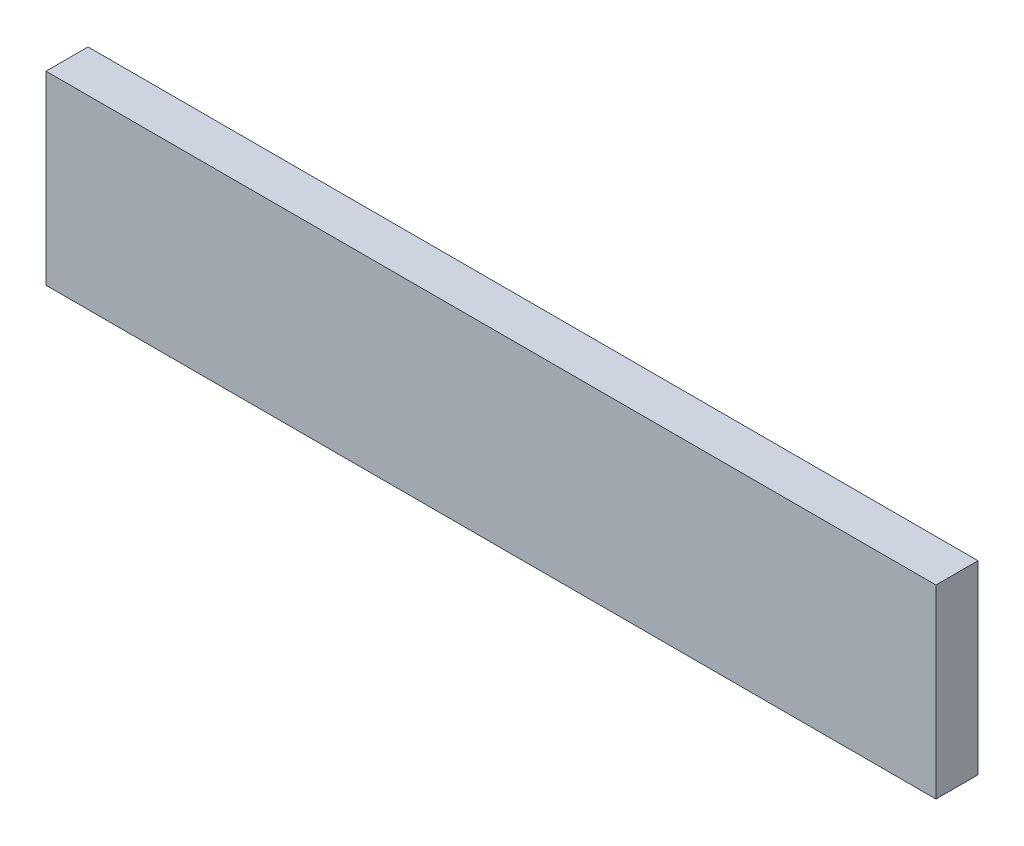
ISO-10303-21;
HEADER;
FILE_DESCRIPTION(('STEP AP214'),'2;1');
FILE_NAME('part.step','',(''),(''),'','','');
FILE_SCHEMA(('AUTOMOTIVE_DESIGN { 1 0 10303 214 1 1 1 1 }'));
ENDSEC;
DATA;
#1=APPLICATION_CONTEXT('core data for automotive mechanical design processes');
#2=APPLICATION_PROTOCOL_DEFINITION('international standard','automotive_design',2000,#1);
#3=PRODUCT_CONTEXT('',#1,'mechanical');
#4=PRODUCT('Part','Part','',(#3));
#5=PRODUCT_RELATED_PRODUCT_CATEGORY('part','',(#4));
#6=PRODUCT_DEFINITION_FORMATION('','',#4);
#7=PRODUCT_DEFINITION_CONTEXT('part definition',#1,'design');
#8=PRODUCT_DEFINITION('design','',#6,#7);
#9=PRODUCT_DEFINITION_SHAPE('','',#8);
#10=(LENGTH_UNIT() NAMED_UNIT(*) SI_UNIT(.MILLI.,.METRE.));
#11=(NAMED_UNIT(*) PLANE_ANGLE_UNIT() SI_UNIT($,.RADIAN.));
#12=(NAMED_UNIT(*) SI_UNIT($,.STERADIAN.) SOLID_ANGLE_UNIT());
#13=UNCERTAINTY_MEASURE_WITH_UNIT(LENGTH_MEASURE(1.E-05),#10,'distance_accuracy_value','');
#14=(GEOMETRIC_REPRESENTATION_CONTEXT(3) GLOBAL_UNCERTAINTY_ASSIGNED_CONTEXT((#13)) GLOBAL_UNIT_ASSIGNED_CONTEXT((#10,
#11,#12)) REPRESENTATION_CONTEXT('',''));
#15=CARTESIAN_POINT('',(0.,0.,0.));
#16=DIRECTION('',(0.,0.,1.));
#17=DIRECTION('',(1.,0.,0.));
#18=AXIS2_PLACEMENT_3D('',#15,#16,#17);
#19=CARTESIAN_POINT('',(0.,0.,7.2));
#20=DIRECTION('',(0.,0.,-1.));
#21=DIRECTION('',(-1.,0.,0.));
#22=AXIS2_PLACEMENT_3D('',#19,#20,#21);
#23=PLANE('',#22);
#24=DIRECTION('',(1.,0.,0.));
#25=VECTOR('',#24,1.);
#26=CARTESIAN_POINT('',(-76.2,15.875,7.2));
#27=LINE('',#26,#25);
#28=CARTESIAN_POINT('',(-76.2,15.875,7.2));
#29=VERTEX_POINT('',#28);
#30=CARTESIAN_POINT('',(76.2,15.875,7.2));
#31=VERTEX_POINT('',#30);
#32=EDGE_CURVE('E66',#29,#31,#27,.T.);
#33=ORIENTED_EDGE('',*,*,#32,.F.);
#34=DIRECTION('',(0.,1.,0.));
#35=VECTOR('',#34,1.);
#36=CARTESIAN_POINT('',(-76.2,-15.875,7.2));
#37=LINE('',#36,#35);
#38=CARTESIAN_POINT('',(-76.2,-15.875,7.2));
#39=VERTEX_POINT('',#38);
#40=EDGE_CURVE('E74',#39,#29,#37,.T.);
#41=ORIENTED_EDGE('',*,*,#40,.F.);
#42=DIRECTION('',(-1.,0.,0.));
#43=VECTOR('',#42,1.);
#44=CARTESIAN_POINT('',(76.2,-15.875,7.2));
#45=LINE('',#44,#43);
#46=CARTESIAN_POINT('',(76.2,-15.875,7.2));
#47=VERTEX_POINT('',#46);
#48=EDGE_CURVE('E68',#47,#39,#45,.T.);
#49=ORIENTED_EDGE('',*,*,#48,.F.);
#50=DIRECTION('',(0.,-1.,0.));
#51=VECTOR('',#50,1.);
#52=CARTESIAN_POINT('',(76.2,15.875,7.2));
#53=LINE('',#52,#51);
#54=EDGE_CURVE('E54',#31,#47,#53,.T.);
#55=ORIENTED_EDGE('',*,*,#54,.F.);
#56=EDGE_LOOP('',(#33,#41,#49,#55));
#57=FACE_BOUND('',#56,.T.);
#58=ADVANCED_FACE('F14',(#57),#23,.F.);
#59=CARTESIAN_POINT('',(76.2,15.875,0.));
#60=DIRECTION('',(1.,0.,0.));
#61=DIRECTION('',(0.,1.,0.));
#62=AXIS2_PLACEMENT_3D('',#59,#60,#61);
#63=PLANE('',#62);
#64=DIRECTION('',(0.,0.,1.));
#65=VECTOR('',#64,1.);
#66=CARTESIAN_POINT('',(76.2,15.875,0.));
#67=LINE('',#66,#65);
#68=CARTESIAN_POINT('',(76.2,15.875,0.));
#69=VERTEX_POINT('',#68);
#70=EDGE_CURVE('E18',#69,#31,#67,.T.);
#71=ORIENTED_EDGE('',*,*,#70,.T.);
#72=ORIENTED_EDGE('',*,*,#54,.T.);
#73=DIRECTION('',(0.,0.,1.));
#74=VECTOR('',#73,1.);
#75=CARTESIAN_POINT('',(76.2,-15.875,0.));
#76=LINE('',#75,#74);
#77=CARTESIAN_POINT('',(76.2,-15.875,0.));
#78=VERTEX_POINT('',#77);
#79=EDGE_CURVE('E9',#78,#47,#76,.T.);
#80=ORIENTED_EDGE('',*,*,#79,.F.);
#81=DIRECTION('',(0.,1.,0.));
#82=VECTOR('',#81,1.);
#83=CARTESIAN_POINT('',(76.2,15.875,0.));
#84=LINE('',#83,#82);
#85=EDGE_CURVE('E55',#78,#69,#84,.T.);
#86=ORIENTED_EDGE('',*,*,#85,.T.);
#87=EDGE_LOOP('',(#71,#72,#80,#86));
#88=FACE_BOUND('',#87,.T.);
#89=ADVANCED_FACE('F16',(#88),#63,.T.);
#90=CARTESIAN_POINT('',(-76.2,-15.875,0.));
#91=DIRECTION('',(0.,-1.,0.));
#92=DIRECTION('',(1.,0.,0.));
#93=AXIS2_PLACEMENT_3D('',#90,#91,#92);
#94=PLANE('',#93);
#95=ORIENTED_EDGE('',*,*,#48,.T.);
#96=DIRECTION('',(0.,0.,1.));
#97=VECTOR('',#96,1.);
#98=CARTESIAN_POINT('',(-76.2,-15.875,0.));
#99=LINE('',#98,#97);
#100=CARTESIAN_POINT('',(-76.2,-15.875,0.));
#101=VERTEX_POINT('',#100);
#102=EDGE_CURVE('E23',#101,#39,#99,.T.);
#103=ORIENTED_EDGE('',*,*,#102,.F.);
#104=DIRECTION('',(1.,0.,0.));
#105=VECTOR('',#104,1.);
#106=CARTESIAN_POINT('',(-76.2,-15.875,0.));
#107=LINE('',#106,#105);
#108=EDGE_CURVE('E61',#101,#78,#107,.T.);
#109=ORIENTED_EDGE('',*,*,#108,.T.);
#110=ORIENTED_EDGE('',*,*,#79,.T.);
#111=EDGE_LOOP('',(#95,#103,#109,#110));
#112=FACE_BOUND('',#111,.T.);
#113=ADVANCED_FACE('F86',(#112),#94,.T.);
#114=CARTESIAN_POINT('',(-76.2,15.875,0.));
#115=DIRECTION('',(-1.,0.,0.));
#116=DIRECTION('',(0.,-1.,0.));
#117=AXIS2_PLACEMENT_3D('',#114,#115,#116);
#118=PLANE('',#117);
#119=ORIENTED_EDGE('',*,*,#102,.T.);
#120=ORIENTED_EDGE('',*,*,#40,.T.);
#121=DIRECTION('',(0.,0.,1.));
#122=VECTOR('',#121,1.);
#123=CARTESIAN_POINT('',(-76.2,15.875,0.));
#124=LINE('',#123,#122);
#125=CARTESIAN_POINT('',(-76.2,15.875,0.));
#126=VERTEX_POINT('',#125);
#127=EDGE_CURVE('E60',#126,#29,#124,.T.);
#128=ORIENTED_EDGE('',*,*,#127,.F.);
#129=DIRECTION('',(0.,-1.,0.));
#130=VECTOR('',#129,1.);
#131=CARTESIAN_POINT('',(-76.2,15.875,0.));
#132=LINE('',#131,#130);
#133=EDGE_CURVE('E79',#126,#101,#132,.T.);
#134=ORIENTED_EDGE('',*,*,#133,.T.);
#135=EDGE_LOOP('',(#119,#120,#128,#134));
#136=FACE_BOUND('',#135,.T.);
#137=ADVANCED_FACE('F83',(#136),#118,.T.);
#138=CARTESIAN_POINT('',(-76.2,15.875,0.));
#139=DIRECTION('',(0.,1.,0.));
#140=DIRECTION('',(-1.,0.,0.));
#141=AXIS2_PLACEMENT_3D('',#138,#139,#140);
#142=PLANE('',#141);
#143=ORIENTED_EDGE('',*,*,#32,.T.);
#144=ORIENTED_EDGE('',*,*,#70,.F.);
#145=DIRECTION('',(-1.,0.,0.));
#146=VECTOR('',#145,1.);
#147=CARTESIAN_POINT('',(-76.2,15.875,0.));
#148=LINE('',#147,#146);
#149=EDGE_CURVE('E77',#69,#126,#148,.T.);
#150=ORIENTED_EDGE('',*,*,#149,.T.);
#151=ORIENTED_EDGE('',*,*,#127,.T.);
#152=EDGE_LOOP('',(#143,#144,#150,#151));
#153=FACE_BOUND('',#152,.T.);
#154=ADVANCED_FACE('F70',(#153),#142,.T.);
#155=CARTESIAN_POINT('',(0.,0.,0.));
#156=DIRECTION('',(0.,0.,1.));
#157=DIRECTION('',(0.,-1.,0.));
#158=AXIS2_PLACEMENT_3D('',#155,#156,#157);
#159=PLANE('',#158);
#160=ORIENTED_EDGE('',*,*,#85,.F.);
#161=ORIENTED_EDGE('',*,*,#108,.F.);
#162=ORIENTED_EDGE('',*,*,#133,.F.);
#163=ORIENTED_EDGE('',*,*,#149,.F.);
#164=EDGE_LOOP('',(#160,#161,#162,#163));
#165=FACE_BOUND('',#164,.T.);
#166=ADVANCED_FACE('F88',(#165),#159,.F.);
#167=CLOSED_SHELL('',(#58,#89,#113,#137,#154,#166));
#168=MANIFOLD_SOLID_BREP('B1',#167);
#169=ADVANCED_BREP_SHAPE_REPRESENTATION('',(#18,#168),#14);
#170=SHAPE_DEFINITION_REPRESENTATION(#9,#169);
ENDSEC;
END-ISO-10303-21;
